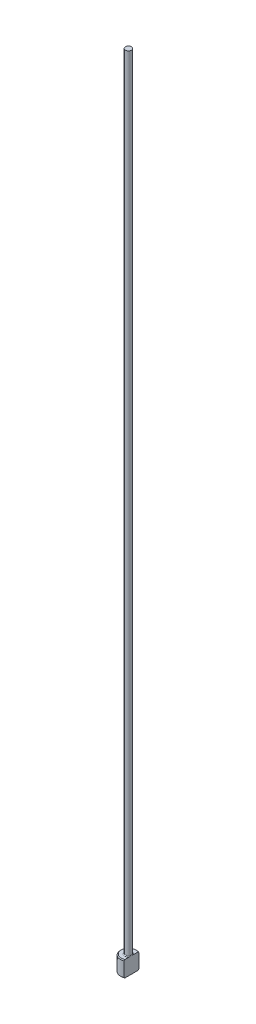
ISO-10303-21;
HEADER;
FILE_DESCRIPTION(('STEP AP214'),'2;1');
FILE_NAME('part.step','',(''),(''),'','','');
FILE_SCHEMA(('AUTOMOTIVE_DESIGN { 1 0 10303 214 1 1 1 1 }'));
ENDSEC;
DATA;
#1=APPLICATION_CONTEXT('core data for automotive mechanical design processes');
#2=APPLICATION_PROTOCOL_DEFINITION('international standard','automotive_design',2000,#1);
#3=PRODUCT_CONTEXT('',#1,'mechanical');
#4=PRODUCT('Part','Part','',(#3));
#5=PRODUCT_RELATED_PRODUCT_CATEGORY('part','',(#4));
#6=PRODUCT_DEFINITION_FORMATION('','',#4);
#7=PRODUCT_DEFINITION_CONTEXT('part definition',#1,'design');
#8=PRODUCT_DEFINITION('design','',#6,#7);
#9=PRODUCT_DEFINITION_SHAPE('','',#8);
#10=(LENGTH_UNIT() NAMED_UNIT(*) SI_UNIT(.MILLI.,.METRE.));
#11=(NAMED_UNIT(*) PLANE_ANGLE_UNIT() SI_UNIT($,.RADIAN.));
#12=(NAMED_UNIT(*) SI_UNIT($,.STERADIAN.) SOLID_ANGLE_UNIT());
#13=UNCERTAINTY_MEASURE_WITH_UNIT(LENGTH_MEASURE(1.E-05),#10,'distance_accuracy_value','');
#14=(GEOMETRIC_REPRESENTATION_CONTEXT(3) GLOBAL_UNCERTAINTY_ASSIGNED_CONTEXT((#13)) GLOBAL_UNIT_ASSIGNED_CONTEXT((#10,
#11,#12)) REPRESENTATION_CONTEXT('',''));
#15=CARTESIAN_POINT('',(0.,0.,0.));
#16=DIRECTION('',(0.,0.,1.));
#17=DIRECTION('',(1.,0.,0.));
#18=AXIS2_PLACEMENT_3D('',#15,#16,#17);
#19=CARTESIAN_POINT('',(0.,0.,0.));
#20=DIRECTION('',(0.,-1.,0.));
#21=DIRECTION('',(0.,0.,-1.));
#22=AXIS2_PLACEMENT_3D('',#19,#20,#21);
#23=PLANE('',#22);
#24=CARTESIAN_POINT('',(0.,0.,0.));
#25=DIRECTION('',(0.,-1.,0.));
#26=DIRECTION('',(0.,0.,-1.));
#27=AXIS2_PLACEMENT_3D('',#24,#25,#26);
#28=CIRCLE('',#27,1.8);
#29=CARTESIAN_POINT('',(0.749999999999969,0.,1.63630681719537));
#30=VERTEX_POINT('',#29);
#31=CARTESIAN_POINT('',(0.749999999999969,0.,-1.63630681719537));
#32=VERTEX_POINT('',#31);
#33=EDGE_CURVE('E98',#30,#32,#28,.T.);
#34=ORIENTED_EDGE('',*,*,#33,.T.);
#35=DIRECTION('',(0.,0.,1.));
#36=VECTOR('',#35,1.);
#37=CARTESIAN_POINT('',(0.749999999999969,0.,1.85404962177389));
#38=LINE('',#37,#36);
#39=EDGE_CURVE('E83',#32,#30,#38,.T.);
#40=ORIENTED_EDGE('',*,*,#39,.T.);
#41=EDGE_LOOP('',(#34,#40));
#42=FACE_BOUND('',#41,.T.);
#43=ADVANCED_FACE('F32',(#42),#23,.T.);
#44=CARTESIAN_POINT('',(0.,259.958771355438,0.));
#45=DIRECTION('',(0.,1.,0.));
#46=DIRECTION('',(0.,0.,1.));
#47=AXIS2_PLACEMENT_3D('',#44,#45,#46);
#48=CYLINDRICAL_SURFACE('',#47,1.99999999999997);
#49=CARTESIAN_POINT('',(0.,3.79999999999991,0.));
#50=DIRECTION('',(0.,1.,0.));
#51=DIRECTION('',(0.,0.,1.));
#52=AXIS2_PLACEMENT_3D('',#49,#50,#51);
#53=CIRCLE('',#52,1.99999999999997);
#54=CARTESIAN_POINT('',(0.749999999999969,3.79999999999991,1.85404962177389));
#55=VERTEX_POINT('',#54);
#56=CARTESIAN_POINT('',(0.749999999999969,3.79999999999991,-1.85404962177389));
#57=VERTEX_POINT('',#56);
#58=EDGE_CURVE('E104',#55,#57,#53,.F.);
#59=ORIENTED_EDGE('',*,*,#58,.T.);
#60=DIRECTION('',(0.,-1.,0.));
#61=VECTOR('',#60,1.);
#62=CARTESIAN_POINT('',(0.749999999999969,200.,-1.85404962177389));
#63=LINE('',#62,#61);
#64=CARTESIAN_POINT('',(0.749999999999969,0.199999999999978,-1.85404962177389));
#65=VERTEX_POINT('',#64);
#66=EDGE_CURVE('E183',#57,#65,#63,.T.);
#67=ORIENTED_EDGE('',*,*,#66,.T.);
#68=CARTESIAN_POINT('',(0.,0.199999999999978,0.));
#69=DIRECTION('',(0.,-1.,0.));
#70=DIRECTION('',(0.,0.,-1.));
#71=AXIS2_PLACEMENT_3D('',#68,#69,#70);
#72=CIRCLE('',#71,1.99999999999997);
#73=CARTESIAN_POINT('',(0.749999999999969,0.199999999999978,1.85404962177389));
#74=VERTEX_POINT('',#73);
#75=EDGE_CURVE('E100',#65,#74,#72,.F.);
#76=ORIENTED_EDGE('',*,*,#75,.T.);
#77=DIRECTION('',(0.,-1.,0.));
#78=VECTOR('',#77,1.);
#79=CARTESIAN_POINT('',(0.749999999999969,200.,1.85404962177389));
#80=LINE('',#79,#78);
#81=EDGE_CURVE('E93',#55,#74,#80,.T.);
#82=ORIENTED_EDGE('',*,*,#81,.F.);
#83=EDGE_LOOP('',(#59,#67,#76,#82));
#84=FACE_BOUND('',#83,.T.);
#85=ADVANCED_FACE('F158',(#84),#48,.T.);
#86=CARTESIAN_POINT('',(-1.99999999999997,4.,0.));
#87=DIRECTION('',(0.,1.,0.));
#88=DIRECTION('',(0.,0.,1.));
#89=AXIS2_PLACEMENT_3D('',#86,#87,#88);
#90=PLANE('',#89);
#91=CARTESIAN_POINT('',(0.,4.,0.));
#92=DIRECTION('',(0.,1.,0.));
#93=DIRECTION('',(0.,0.,1.));
#94=AXIS2_PLACEMENT_3D('',#91,#92,#93);
#95=CIRCLE('',#94,1.79999999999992);
#96=CARTESIAN_POINT('',(0.749999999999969,4.,-1.63630681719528));
#97=VERTEX_POINT('',#96);
#98=CARTESIAN_POINT('',(0.749999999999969,4.,1.63630681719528));
#99=VERTEX_POINT('',#98);
#100=EDGE_CURVE('E178',#97,#99,#95,.T.);
#101=ORIENTED_EDGE('',*,*,#100,.T.);
#102=DIRECTION('',(0.,0.,-1.));
#103=VECTOR('',#102,1.);
#104=CARTESIAN_POINT('',(0.749999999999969,4.,0.));
#105=LINE('',#104,#103);
#106=CARTESIAN_POINT('',(0.749999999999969,3.99999999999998,0.583095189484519));
#107=VERTEX_POINT('',#106);
#108=EDGE_CURVE('E57',#99,#107,#105,.T.);
#109=ORIENTED_EDGE('',*,*,#108,.T.);
#110=CARTESIAN_POINT('',(0.,4.,0.));
#111=DIRECTION('',(0.,1.,0.));
#112=DIRECTION('',(0.,0.,1.));
#113=AXIS2_PLACEMENT_3D('',#110,#111,#112);
#114=CIRCLE('',#113,0.949999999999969);
#115=CARTESIAN_POINT('',(0.749999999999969,3.99999999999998,-0.583095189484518));
#116=VERTEX_POINT('',#115);
#117=EDGE_CURVE('E107',#107,#116,#114,.F.);
#118=ORIENTED_EDGE('',*,*,#117,.T.);
#119=EDGE_CURVE('E136',#116,#97,#105,.T.);
#120=ORIENTED_EDGE('',*,*,#119,.T.);
#121=EDGE_LOOP('',(#101,#109,#118,#120));
#122=FACE_BOUND('',#121,.T.);
#123=ADVANCED_FACE('F147',(#122),#90,.T.);
#124=CARTESIAN_POINT('',(0.,4.,0.));
#125=DIRECTION('',(0.,-1.,0.));
#126=DIRECTION('',(0.,0.,-1.));
#127=AXIS2_PLACEMENT_3D('',#124,#125,#126);
#128=CONICAL_SURFACE('',#127,1.79999999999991,0.785398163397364);
#129=ORIENTED_EDGE('',*,*,#58,.F.);
#130=CARTESIAN_POINT('',(0.749999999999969,1.64933448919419,4.08234297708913));
#131=CARTESIAN_POINT('',(0.749999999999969,1.7568632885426,3.97300940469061));
#132=CARTESIAN_POINT('',(0.749999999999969,1.86432546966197,3.86361021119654));
#133=CARTESIAN_POINT('',(0.749999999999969,2.07918719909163,3.64450528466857));
#134=CARTESIAN_POINT('',(0.749999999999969,2.18658653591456,3.53479934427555));
#135=CARTESIAN_POINT('',(0.749999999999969,2.403309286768,3.31294195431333));
#136=CARTESIAN_POINT('',(0.749999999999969,2.51262786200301,3.20078577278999));
#137=CARTESIAN_POINT('',(0.749999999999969,2.73079905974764,2.97627027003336));
#138=CARTESIAN_POINT('',(0.749999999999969,2.83965207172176,2.86391132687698));
#139=CARTESIAN_POINT('',(0.749999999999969,3.12410072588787,2.56910579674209));
#140=CARTESIAN_POINT('',(0.749999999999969,3.29932702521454,2.38630095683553));
#141=CARTESIAN_POINT('',(0.749999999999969,3.56081447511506,2.11005080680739));
#142=CARTESIAN_POINT('',(0.749999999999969,3.64793893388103,2.01742399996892));
#143=CARTESIAN_POINT('',(0.749999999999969,3.82126966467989,1.83139888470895));
#144=CARTESIAN_POINT('',(0.749999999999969,3.90747636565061,1.7380009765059));
#145=CARTESIAN_POINT('',(0.749999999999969,4.07705927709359,1.55161637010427));
#146=CARTESIAN_POINT('',(0.749999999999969,4.16045863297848,1.4586508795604));
#147=CARTESIAN_POINT('',(0.749999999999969,4.2839983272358,1.31767418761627));
#148=CARTESIAN_POINT('',(0.749999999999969,4.324956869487,1.27038111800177));
#149=CARTESIAN_POINT('',(0.749999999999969,4.40612814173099,1.17516037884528));
#150=CARTESIAN_POINT('',(0.749999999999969,4.44634090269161,1.1272327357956));
#151=CARTESIAN_POINT('',(0.749999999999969,4.52542294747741,1.03092047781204));
#152=CARTESIAN_POINT('',(0.749999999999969,4.56430041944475,0.982542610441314));
#153=CARTESIAN_POINT('',(0.749999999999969,4.64060877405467,0.88466385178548));
#154=CARTESIAN_POINT('',(0.749999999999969,4.67803993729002,0.835163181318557));
#155=CARTESIAN_POINT('',(0.749999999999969,4.75064212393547,0.734748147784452));
#156=CARTESIAN_POINT('',(0.749999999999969,4.78581957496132,0.683838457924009));
#157=CARTESIAN_POINT('',(0.749999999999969,4.85281471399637,0.579868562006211));
#158=CARTESIAN_POINT('',(0.749999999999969,4.8846364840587,0.526811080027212));
#159=CARTESIAN_POINT('',(0.749999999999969,4.92004236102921,0.460353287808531));
#160=CARTESIAN_POINT('',(0.749999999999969,4.92626425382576,0.448355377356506));
#161=CARTESIAN_POINT('',(0.749999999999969,4.93840821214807,0.424205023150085));
#162=CARTESIAN_POINT('',(0.749999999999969,4.94433019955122,0.412052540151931));
#163=CARTESIAN_POINT('',(0.749999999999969,4.96159246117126,0.375357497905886));
#164=CARTESIAN_POINT('',(0.749999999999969,4.97243059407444,0.350574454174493));
#165=CARTESIAN_POINT('',(0.749999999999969,4.99232429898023,0.300598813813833));
#166=CARTESIAN_POINT('',(0.749999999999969,5.00139743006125,0.275413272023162));
#167=CARTESIAN_POINT('',(0.749999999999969,5.01752532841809,0.224391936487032));
#168=CARTESIAN_POINT('',(0.749999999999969,5.02458006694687,0.198556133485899));
#169=CARTESIAN_POINT('',(0.749999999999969,5.03526259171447,0.150878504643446));
#170=CARTESIAN_POINT('',(0.749999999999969,5.03927292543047,0.129123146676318));
#171=CARTESIAN_POINT('',(0.749999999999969,5.04546996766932,0.0853625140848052));
#172=CARTESIAN_POINT('',(0.749999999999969,5.04765728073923,0.0633573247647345));
#173=CARTESIAN_POINT('',(0.749999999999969,5.05127090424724,-0.00270951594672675));
#174=CARTESIAN_POINT('',(0.749999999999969,5.04978253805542,-0.04696569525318));
#175=CARTESIAN_POINT('',(0.749999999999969,5.03814860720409,-0.143936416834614));
#176=CARTESIAN_POINT('',(0.749999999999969,5.02621240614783,-0.196426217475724));
#177=CARTESIAN_POINT('',(0.749999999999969,5.00214641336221,-0.273272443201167));
#178=CARTESIAN_POINT('',(0.749999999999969,4.99304774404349,-0.298672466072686));
#179=CARTESIAN_POINT('',(0.749999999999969,4.9731746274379,-0.348806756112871));
#180=CARTESIAN_POINT('',(0.749999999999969,4.96240055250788,-0.373541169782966));
#181=CARTESIAN_POINT('',(0.749999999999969,4.92901260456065,-0.444792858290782));
#182=CARTESIAN_POINT('',(0.749999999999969,4.90460879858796,-0.490464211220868));
#183=CARTESIAN_POINT('',(0.749999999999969,4.85261191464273,-0.579972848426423));
#184=CARTESIAN_POINT('',(0.749999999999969,4.82501493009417,-0.62380779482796));
#185=CARTESIAN_POINT('',(0.749999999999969,4.76759807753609,-0.710209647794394));
#186=CARTESIAN_POINT('',(0.749999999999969,4.73777062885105,-0.752771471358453));
#187=CARTESIAN_POINT('',(0.749999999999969,4.67663657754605,-0.836824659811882));
#188=CARTESIAN_POINT('',(0.749999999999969,4.64532962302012,-0.878315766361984));
#189=CARTESIAN_POINT('',(0.749999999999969,4.5812089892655,-0.961064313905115));
#190=CARTESIAN_POINT('',(0.749999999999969,4.5483801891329,-1.00230998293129));
#191=CARTESIAN_POINT('',(0.749999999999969,4.48192435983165,-1.08415466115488));
#192=CARTESIAN_POINT('',(0.749999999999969,4.4482972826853,-1.12475363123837));
#193=CARTESIAN_POINT('',(0.749999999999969,4.34669509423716,-1.24559513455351));
#194=CARTESIAN_POINT('',(0.749999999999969,4.2778337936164,-1.32509096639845));
#195=CARTESIAN_POINT('',(0.749999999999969,4.10242211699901,-1.52396732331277));
#196=CARTESIAN_POINT('',(0.749999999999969,3.99494650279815,-1.64252540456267));
#197=CARTESIAN_POINT('',(0.749999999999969,3.77825048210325,-1.8780457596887));
#198=CARTESIAN_POINT('',(0.749999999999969,3.66902991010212,-1.99500788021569));
#199=CARTESIAN_POINT('',(0.749999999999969,3.44939263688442,-2.22808772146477));
#200=CARTESIAN_POINT('',(0.749999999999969,3.33897457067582,-2.34420415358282));
#201=CARTESIAN_POINT('',(0.749999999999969,3.11746229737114,-2.57577975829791));
#202=CARTESIAN_POINT('',(0.749999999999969,3.00636811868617,-2.69123895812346));
#203=CARTESIAN_POINT('',(0.749999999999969,2.79171284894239,-2.91342601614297));
#204=CARTESIAN_POINT('',(0.749999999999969,2.68818407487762,-3.0201851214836));
#205=CARTESIAN_POINT('',(0.749999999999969,2.48083134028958,-3.23341885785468));
#206=CARTESIAN_POINT('',(0.749999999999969,2.37700737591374,-3.33989348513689));
#207=CARTESIAN_POINT('',(0.749999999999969,2.16930389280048,-3.55245914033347));
#208=CARTESIAN_POINT('',(0.749999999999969,2.06542472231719,-3.658550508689));
#209=CARTESIAN_POINT('',(0.749999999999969,1.85749599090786,-3.87056274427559));
#210=CARTESIAN_POINT('',(0.749999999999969,1.75344643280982,-3.97648361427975));
#211=CARTESIAN_POINT('',(0.749999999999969,1.64933448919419,-4.08234297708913));
#212=B_SPLINE_CURVE_WITH_KNOTS('',3,(#130,#131,#132,#133,#134,#135,#136,#137,#138,#139,#140,
#141,#142,#143,#144,#145,#146,#147,#148,#149,#150,#151,#152,#153,#154,#155,#156,#157,#158,#159,
#160,#161,#162,#163,#164,#165,#166,#167,#168,#169,#170,#171,#172,#173,#174,#175,#176,#177,#178,
#179,#180,#181,#182,#183,#184,#185,#186,#187,#188,#189,#190,#191,#192,#193,#194,#195,#196,#197,
#198,#199,#200,#201,#202,#203,#204,#205,#206,#207,#208,#209,#210,#211),.UNSPECIFIED.,.F.,.F.,(4,
2,2,2,2,2,2,2,2,2,2,2,2,2,2,2,2,2,2,2,2,2,2,2,2,2,2,2,2,2,2,2,2,2,2,2,2,2,2,2,4),(0.,
0.460050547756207,0.920626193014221,1.39048289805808,1.85980320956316,2.61945882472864,
3.00094349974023,3.38224127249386,3.75689298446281,3.94457922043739,4.1322576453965,
4.31843090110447,4.50456785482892,4.69014785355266,4.875499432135,4.91604145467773,
4.95659398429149,5.03768920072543,5.11793098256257,5.19817390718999,5.26446717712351,
5.33073845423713,5.46284570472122,5.62332534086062,5.70422568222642,5.78510806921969,
5.940234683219,6.09555312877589,6.25142580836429,6.40733575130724,6.56546927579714,
6.72361232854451,7.03910022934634,7.5191330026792,7.99921158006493,8.47991142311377,
8.96059120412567,9.4067310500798,9.85287674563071,10.2983160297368,10.7437479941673),.UNSPECIFIED.);
#213=EDGE_CURVE('E135',#55,#99,#212,.T.);
#214=ORIENTED_EDGE('',*,*,#213,.T.);
#215=ORIENTED_EDGE('',*,*,#100,.F.);
#216=EDGE_CURVE('E127',#97,#57,#212,.T.);
#217=ORIENTED_EDGE('',*,*,#216,.T.);
#218=EDGE_LOOP('',(#129,#214,#215,#217));
#219=FACE_BOUND('',#218,.T.);
#220=ADVANCED_FACE('F143',(#219),#128,.T.);
#221=CARTESIAN_POINT('',(0.,0.199999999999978,0.));
#222=DIRECTION('',(0.,1.,0.));
#223=DIRECTION('',(0.,0.,1.));
#224=AXIS2_PLACEMENT_3D('',#221,#222,#223);
#225=CONICAL_SURFACE('',#224,1.99999999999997,0.785398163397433);
#226=ORIENTED_EDGE('',*,*,#75,.F.);
#227=CARTESIAN_POINT('',(0.749999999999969,2.3506655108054,-4.08234297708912));
#228=CARTESIAN_POINT('',(0.749999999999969,2.24313671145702,-3.97300940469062));
#229=CARTESIAN_POINT('',(0.749999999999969,2.13567453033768,-3.86361021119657));
#230=CARTESIAN_POINT('',(0.749999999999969,1.92081280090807,-3.64450528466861));
#231=CARTESIAN_POINT('',(0.749999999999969,1.81341346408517,-3.5347993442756));
#232=CARTESIAN_POINT('',(0.749999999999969,1.59669071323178,-3.31294195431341));
#233=CARTESIAN_POINT('',(0.749999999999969,1.48737213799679,-3.20078577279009));
#234=CARTESIAN_POINT('',(0.749999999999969,1.26920094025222,-2.97627027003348));
#235=CARTESIAN_POINT('',(0.749999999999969,1.16034792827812,-2.86391132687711));
#236=CARTESIAN_POINT('',(0.749999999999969,0.87589927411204,-2.56910579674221));
#237=CARTESIAN_POINT('',(0.749999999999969,0.700672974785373,-2.38630095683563));
#238=CARTESIAN_POINT('',(0.749999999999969,0.439185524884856,-2.11005080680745));
#239=CARTESIAN_POINT('',(0.749999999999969,0.352061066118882,-2.01742399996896));
#240=CARTESIAN_POINT('',(0.749999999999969,0.178730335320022,-1.83139888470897));
#241=CARTESIAN_POINT('',(0.749999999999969,0.0925236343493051,-1.73800097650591));
#242=CARTESIAN_POINT('',(0.749999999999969,-0.07705927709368,-1.55161637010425));
#243=CARTESIAN_POINT('',(0.749999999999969,-0.160458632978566,-1.45865087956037));
#244=CARTESIAN_POINT('',(0.749999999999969,-0.283998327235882,-1.31767418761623));
#245=CARTESIAN_POINT('',(0.749999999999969,-0.324956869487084,-1.27038111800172));
#246=CARTESIAN_POINT('',(0.749999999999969,-0.406128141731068,-1.17516037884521));
#247=CARTESIAN_POINT('',(0.749999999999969,-0.446340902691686,-1.12723273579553));
#248=CARTESIAN_POINT('',(0.749999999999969,-0.525422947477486,-1.03092047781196));
#249=CARTESIAN_POINT('',(0.749999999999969,-0.564300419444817,-0.982542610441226));
#250=CARTESIAN_POINT('',(0.749999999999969,-0.64060877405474,-0.88466385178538));
#251=CARTESIAN_POINT('',(0.749999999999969,-0.678039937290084,-0.835163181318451));
#252=CARTESIAN_POINT('',(0.749999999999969,-0.750642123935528,-0.734748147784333));
#253=CARTESIAN_POINT('',(0.749999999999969,-0.785819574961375,-0.683838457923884));
#254=CARTESIAN_POINT('',(0.749999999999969,-0.85281471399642,-0.579868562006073));
#255=CARTESIAN_POINT('',(0.749999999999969,-0.884636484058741,-0.526811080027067));
#256=CARTESIAN_POINT('',(0.749999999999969,-0.920042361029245,-0.460353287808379));
#257=CARTESIAN_POINT('',(0.749999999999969,-0.926264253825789,-0.448355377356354));
#258=CARTESIAN_POINT('',(0.749999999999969,-0.938408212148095,-0.424205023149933));
#259=CARTESIAN_POINT('',(0.749999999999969,-0.944330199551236,-0.41205254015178));
#260=CARTESIAN_POINT('',(0.749999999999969,-0.96159246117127,-0.375357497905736));
#261=CARTESIAN_POINT('',(0.749999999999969,-0.972430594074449,-0.350574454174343));
#262=CARTESIAN_POINT('',(0.749999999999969,-0.992324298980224,-0.300598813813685));
#263=CARTESIAN_POINT('',(0.749999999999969,-1.00139743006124,-0.275413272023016));
#264=CARTESIAN_POINT('',(0.749999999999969,-1.01752532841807,-0.224391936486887));
#265=CARTESIAN_POINT('',(0.749999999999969,-1.02458006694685,-0.198556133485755));
#266=CARTESIAN_POINT('',(0.749999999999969,-1.03526259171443,-0.150878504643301));
#267=CARTESIAN_POINT('',(0.749999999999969,-1.03927292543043,-0.12912314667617));
#268=CARTESIAN_POINT('',(0.749999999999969,-1.04546996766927,-0.0853625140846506));
#269=CARTESIAN_POINT('',(0.749999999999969,-1.04765728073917,-0.0633573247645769));
#270=CARTESIAN_POINT('',(0.749999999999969,-1.05127090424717,0.00270951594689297));
#271=CARTESIAN_POINT('',(0.749999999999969,-1.04978253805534,0.046965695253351));
#272=CARTESIAN_POINT('',(0.749999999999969,-1.03814860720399,0.143936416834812));
#273=CARTESIAN_POINT('',(0.749999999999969,-1.02621240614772,0.196426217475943));
#274=CARTESIAN_POINT('',(0.749999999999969,-1.00214641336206,0.273272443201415));
#275=CARTESIAN_POINT('',(0.749999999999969,-0.993047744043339,0.298672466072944));
#276=CARTESIAN_POINT('',(0.749999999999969,-0.973174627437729,0.348806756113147));
#277=CARTESIAN_POINT('',(0.749999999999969,-0.9624005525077,0.373541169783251));
#278=CARTESIAN_POINT('',(0.749999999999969,-0.929012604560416,0.444792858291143));
#279=CARTESIAN_POINT('',(0.749999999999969,-0.904608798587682,0.490464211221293));
#280=CARTESIAN_POINT('',(0.749999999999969,-0.85261191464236,0.579972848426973));
#281=CARTESIAN_POINT('',(0.749999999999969,-0.825014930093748,0.62380779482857));
#282=CARTESIAN_POINT('',(0.749999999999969,-0.767598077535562,0.710209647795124));
#283=CARTESIAN_POINT('',(0.749999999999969,-0.737770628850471,0.752771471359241));
#284=CARTESIAN_POINT('',(0.749999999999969,-0.676636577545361,0.836824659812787));
#285=CARTESIAN_POINT('',(0.749999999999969,-0.645329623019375,0.878315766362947));
#286=CARTESIAN_POINT('',(0.749999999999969,-0.58120898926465,0.961064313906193));
#287=CARTESIAN_POINT('',(0.749999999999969,-0.548380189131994,1.00230998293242));
#288=CARTESIAN_POINT('',(0.749999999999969,-0.481924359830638,1.08415466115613));
#289=CARTESIAN_POINT('',(0.749999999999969,-0.448297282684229,1.12475363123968));
#290=CARTESIAN_POINT('',(0.749999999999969,-0.346695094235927,1.24559513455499));
#291=CARTESIAN_POINT('',(0.749999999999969,-0.277833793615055,1.32509096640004));
#292=CARTESIAN_POINT('',(0.749999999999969,-0.102422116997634,1.52396732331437));
#293=CARTESIAN_POINT('',(0.749999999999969,0.00505349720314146,1.64252540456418));
#294=CARTESIAN_POINT('',(0.749999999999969,0.221749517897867,1.87804575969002));
#295=CARTESIAN_POINT('',(0.749999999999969,0.330970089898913,1.99500788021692));
#296=CARTESIAN_POINT('',(0.749999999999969,0.550607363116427,2.22808772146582));
#297=CARTESIAN_POINT('',(0.749999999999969,0.661025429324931,2.34420415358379));
#298=CARTESIAN_POINT('',(0.749999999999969,0.882537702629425,2.57577975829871));
#299=CARTESIAN_POINT('',(0.749999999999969,0.993631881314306,2.69123895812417));
#300=CARTESIAN_POINT('',(0.749999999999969,1.20828715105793,2.91342601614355));
#301=CARTESIAN_POINT('',(0.749999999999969,1.31181592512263,3.02018512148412));
#302=CARTESIAN_POINT('',(0.749999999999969,1.51916865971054,3.2334188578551));
#303=CARTESIAN_POINT('',(0.749999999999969,1.62299262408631,3.33989348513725));
#304=CARTESIAN_POINT('',(0.749999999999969,1.83069610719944,3.55245914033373));
#305=CARTESIAN_POINT('',(0.749999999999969,1.93457527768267,3.65855050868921));
#306=CARTESIAN_POINT('',(0.749999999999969,2.14250400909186,3.87056274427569));
#307=CARTESIAN_POINT('',(0.749999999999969,2.24655356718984,3.9764836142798));
#308=CARTESIAN_POINT('',(0.749999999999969,2.3506655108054,4.08234297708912));
#309=B_SPLINE_CURVE_WITH_KNOTS('',3,(#227,#228,#229,#230,#231,#232,#233,#234,#235,#236,#237,
#238,#239,#240,#241,#242,#243,#244,#245,#246,#247,#248,#249,#250,#251,#252,#253,#254,#255,#256,
#257,#258,#259,#260,#261,#262,#263,#264,#265,#266,#267,#268,#269,#270,#271,#272,#273,#274,#275,
#276,#277,#278,#279,#280,#281,#282,#283,#284,#285,#286,#287,#288,#289,#290,#291,#292,#293,#294,
#295,#296,#297,#298,#299,#300,#301,#302,#303,#304,#305,#306,#307,#308),.UNSPECIFIED.,.F.,.F.,(4,
2,2,2,2,2,2,2,2,2,2,2,2,2,2,2,2,2,2,2,2,2,2,2,2,2,2,2,2,2,2,2,2,2,2,2,2,2,2,2,4),(0.,
0.460050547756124,0.920626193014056,1.39048289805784,1.85980320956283,2.61945882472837,
3.00094349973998,3.38224127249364,3.75689298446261,3.94457922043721,4.13225764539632,
4.3184309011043,4.50456785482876,4.69014785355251,4.87549943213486,4.91604145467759,
4.95659398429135,5.03768920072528,5.11793098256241,5.19817390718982,5.26446717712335,
5.33073845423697,5.46284570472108,5.62332534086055,5.70422568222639,5.78510806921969,
5.94023468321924,6.09555312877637,6.251425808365,6.40733575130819,6.56546927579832,
6.72361232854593,7.03910022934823,7.51913300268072,7.99921158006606,8.47991142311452,
8.96059120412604,9.40673105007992,9.85287674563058,10.2983160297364,10.7437479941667),.UNSPECIFIED.);
#310=EDGE_CURVE('E86',#65,#32,#309,.T.);
#311=ORIENTED_EDGE('',*,*,#310,.T.);
#312=ORIENTED_EDGE('',*,*,#33,.F.);
#313=EDGE_CURVE('E89',#30,#74,#309,.T.);
#314=ORIENTED_EDGE('',*,*,#313,.T.);
#315=EDGE_LOOP('',(#226,#311,#312,#314));
#316=FACE_BOUND('',#315,.T.);
#317=ADVANCED_FACE('F97',(#316),#225,.T.);
#318=CARTESIAN_POINT('',(0.,4.19999999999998,0.));
#319=DIRECTION('',(0.,1.,0.));
#320=DIRECTION('',(0.,0.,1.));
#321=AXIS2_PLACEMENT_3D('',#318,#319,#320);
#322=TOROIDAL_SURFACE('',#321,0.949999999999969,0.2);
#323=CARTESIAN_POINT('',(0.749999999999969,4.19999999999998,0.));
#324=CARTESIAN_POINT('',(0.749999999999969,4.20000052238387,0.));
#325=CARTESIAN_POINT('',(0.749999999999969,4.20000104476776,-7.92518434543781E-08));
#326=CARTESIAN_POINT('',(0.749999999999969,4.20000206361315,-3.453450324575E-07));
#327=CARTESIAN_POINT('',(0.749999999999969,4.20000255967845,-5.33493155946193E-07));
#328=CARTESIAN_POINT('',(0.749999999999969,4.20000354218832,-9.91557928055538E-07));
#329=CARTESIAN_POINT('',(0.749999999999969,4.20000402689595,-1.26510932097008E-06));
#330=CARTESIAN_POINT('',(0.749999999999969,4.20000495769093,-1.86638897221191E-06));
#331=CARTESIAN_POINT('',(0.749999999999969,4.20000540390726,-2.19392467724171E-06));
#332=CARTESIAN_POINT('',(0.749999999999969,4.20000683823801,-3.3337095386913E-06));
#333=CARTESIAN_POINT('',(0.749999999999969,4.20000776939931,-4.21820144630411E-06));
#334=CARTESIAN_POINT('',(0.749999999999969,4.20000948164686,-6.08403167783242E-06));
#335=CARTESIAN_POINT('',(0.749999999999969,4.20001026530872,-7.06314146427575E-06));
#336=CARTESIAN_POINT('',(0.749999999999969,4.20001305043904,-1.07283300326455E-05));
#337=CARTESIAN_POINT('',(0.749999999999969,4.20001489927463,-1.35334971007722E-05));
#338=CARTESIAN_POINT('',(0.749999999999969,4.20001806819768,-1.91887701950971E-05));
#339=CARTESIAN_POINT('',(0.749999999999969,4.20001941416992,-2.20250298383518E-05));
#340=CARTESIAN_POINT('',(0.749999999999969,4.20002483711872,-3.36357626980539E-05));
#341=CARTESIAN_POINT('',(0.749999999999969,4.20002876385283,-4.24755662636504E-05));
#342=CARTESIAN_POINT('',(0.749999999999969,4.20003535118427,-5.93015819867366E-05));
#343=CARTESIAN_POINT('',(0.749999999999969,4.20003811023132,-6.72480837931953E-05));
#344=CARTESIAN_POINT('',(0.749999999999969,4.20005910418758,-0.000122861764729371));
#345=CARTESIAN_POINT('',(0.749999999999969,4.2000847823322,-0.000167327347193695));
#346=CARTESIAN_POINT('',(0.749999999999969,4.20017912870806,-0.00033728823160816));
#347=CARTESIAN_POINT('',(0.749999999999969,4.20024226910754,-0.000465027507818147));
#348=CARTESIAN_POINT('',(0.749999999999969,4.20048606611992,-0.000950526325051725));
#349=CARTESIAN_POINT('',(0.749999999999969,4.20067249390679,-0.00130597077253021));
#350=CARTESIAN_POINT('',(0.749999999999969,4.20141452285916,-0.00272815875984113));
#351=CARTESIAN_POINT('',(0.749999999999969,4.20196367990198,-0.00379745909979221));
#352=CARTESIAN_POINT('',(0.749999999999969,4.21079317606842,-0.0209810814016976));
#353=CARTESIAN_POINT('',(0.749999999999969,4.21912708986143,-0.0370747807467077));
#354=CARTESIAN_POINT('',(0.749999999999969,4.23538169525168,-0.0687945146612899));
#355=CARTESIAN_POINT('',(0.749999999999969,4.24330692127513,-0.0844183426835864));
#356=CARTESIAN_POINT('',(0.749999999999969,4.25980152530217,-0.117412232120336));
#357=CARTESIAN_POINT('',(0.749999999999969,4.2683506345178,-0.134792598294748));
#358=CARTESIAN_POINT('',(0.749999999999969,4.28516256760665,-0.169887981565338));
#359=CARTESIAN_POINT('',(0.749999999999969,4.29342203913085,-0.187604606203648));
#360=CARTESIAN_POINT('',(0.749999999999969,4.31367684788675,-0.232718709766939));
#361=CARTESIAN_POINT('',(0.749999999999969,4.32533268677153,-0.260271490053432));
#362=CARTESIAN_POINT('',(0.749999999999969,4.34666110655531,-0.315501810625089));
#363=CARTESIAN_POINT('',(0.749999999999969,4.35636938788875,-0.343165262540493));
#364=CARTESIAN_POINT('',(0.749999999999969,4.37268127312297,-0.396748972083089));
#365=CARTESIAN_POINT('',(0.749999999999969,4.379483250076,-0.42260763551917));
#366=CARTESIAN_POINT('',(0.749999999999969,4.39076706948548,-0.476103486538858));
#367=CARTESIAN_POINT('',(0.749999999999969,4.39512718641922,-0.503767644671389));
#368=CARTESIAN_POINT('',(0.749999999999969,4.40012258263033,-0.559350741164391));
#369=CARTESIAN_POINT('',(0.749999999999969,4.40077276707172,-0.587268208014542));
#370=CARTESIAN_POINT('',(0.749999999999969,4.39725531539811,-0.642496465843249));
#371=CARTESIAN_POINT('',(0.749999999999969,4.39315871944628,-0.669810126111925));
#372=CARTESIAN_POINT('',(0.749999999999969,4.38226759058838,-0.710376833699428));
#373=CARTESIAN_POINT('',(0.749999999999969,4.37764112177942,-0.724213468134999));
#374=CARTESIAN_POINT('',(0.749999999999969,4.36645438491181,-0.751128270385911));
#375=CARTESIAN_POINT('',(0.749999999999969,4.3598916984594,-0.764205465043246));
#376=CARTESIAN_POINT('',(0.749999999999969,4.34591711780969,-0.787020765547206));
#377=CARTESIAN_POINT('',(0.749999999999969,4.33882518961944,-0.796953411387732));
#378=CARTESIAN_POINT('',(0.749999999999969,4.32312129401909,-0.815534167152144));
#379=CARTESIAN_POINT('',(0.749999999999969,4.31451194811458,-0.824184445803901));
#380=CARTESIAN_POINT('',(0.749999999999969,4.29770708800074,-0.838172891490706));
#381=CARTESIAN_POINT('',(0.749999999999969,4.2897756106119,-0.843827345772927));
#382=CARTESIAN_POINT('',(0.749999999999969,4.27308433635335,-0.853755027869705));
#383=CARTESIAN_POINT('',(0.749999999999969,4.26432487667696,-0.858028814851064));
#384=CARTESIAN_POINT('',(0.749999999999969,4.24611994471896,-0.864966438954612));
#385=CARTESIAN_POINT('',(0.749999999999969,4.23667052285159,-0.86762003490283));
#386=CARTESIAN_POINT('',(0.749999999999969,4.21743927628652,-0.871086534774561));
#387=CARTESIAN_POINT('',(0.749999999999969,4.207657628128,-0.871900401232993));
#388=CARTESIAN_POINT('',(0.749999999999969,4.18916476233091,-0.871644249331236));
#389=CARTESIAN_POINT('',(0.749999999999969,4.18045031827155,-0.870765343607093));
#390=CARTESIAN_POINT('',(0.749999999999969,4.16329782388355,-0.867547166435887));
#391=CARTESIAN_POINT('',(0.749999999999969,4.15485975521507,-0.865207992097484));
#392=CARTESIAN_POINT('',(0.749999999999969,4.138510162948,-0.859212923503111));
#393=CARTESIAN_POINT('',(0.749999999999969,4.13059660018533,-0.855562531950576));
#394=CARTESIAN_POINT('',(0.749999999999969,4.11540880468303,-0.847119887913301));
#395=CARTESIAN_POINT('',(0.749999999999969,4.10813470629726,-0.842327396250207));
#396=CARTESIAN_POINT('',(0.749999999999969,4.09350795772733,-0.831172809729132));
#397=CARTESIAN_POINT('',(0.749999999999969,4.08624574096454,-0.824692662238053));
#398=CARTESIAN_POINT('',(0.749999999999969,4.07268239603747,-0.810794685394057));
#399=CARTESIAN_POINT('',(0.749999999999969,4.06638225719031,-0.803375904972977));
#400=CARTESIAN_POINT('',(0.749999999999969,4.05147186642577,-0.783446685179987));
#401=CARTESIAN_POINT('',(0.749999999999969,4.04355238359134,-0.770417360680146));
#402=CARTESIAN_POINT('',(0.749999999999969,4.02991429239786,-0.743286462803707));
#403=CARTESIAN_POINT('',(0.749999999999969,4.02419651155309,-0.729184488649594));
#404=CARTESIAN_POINT('',(0.749999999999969,4.01257018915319,-0.693822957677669));
#405=CARTESIAN_POINT('',(0.749999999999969,4.00774380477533,-0.672209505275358));
#406=CARTESIAN_POINT('',(0.749999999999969,4.00145191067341,-0.628298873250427));
#407=CARTESIAN_POINT('',(0.749999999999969,4.0000267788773,-0.605996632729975));
#408=CARTESIAN_POINT('',(0.749999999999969,3.99995578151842,-0.54611119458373));
#409=CARTESIAN_POINT('',(0.749999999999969,4.00388309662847,-0.508527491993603));
#410=CARTESIAN_POINT('',(0.749999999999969,4.01373246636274,-0.453837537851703));
#411=CARTESIAN_POINT('',(0.749999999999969,4.01754666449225,-0.436272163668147));
#412=CARTESIAN_POINT('',(0.749999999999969,4.02621031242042,-0.401484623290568));
#413=CARTESIAN_POINT('',(0.749999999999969,4.03105449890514,-0.38426118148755));
#414=CARTESIAN_POINT('',(0.749999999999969,4.04486296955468,-0.339542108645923));
#415=CARTESIAN_POINT('',(0.749999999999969,4.05452531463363,-0.312264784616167));
#416=CARTESIAN_POINT('',(0.749999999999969,4.07570310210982,-0.257776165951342));
#417=CARTESIAN_POINT('',(0.749999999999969,4.08725400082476,-0.230578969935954));
#418=CARTESIAN_POINT('',(0.749999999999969,4.10733071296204,-0.185975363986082));
#419=CARTESIAN_POINT('',(0.749999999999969,4.11553018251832,-0.168419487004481));
#420=CARTESIAN_POINT('',(0.749999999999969,4.13221303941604,-0.133639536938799));
#421=CARTESIAN_POINT('',(0.749999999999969,4.14069316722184,-0.116413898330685));
#422=CARTESIAN_POINT('',(0.749999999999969,4.15705001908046,-0.0837133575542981));
#423=CARTESIAN_POINT('',(0.749999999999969,4.16490699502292,-0.0682284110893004));
#424=CARTESIAN_POINT('',(0.749999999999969,4.18101978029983,-0.0367899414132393));
#425=CARTESIAN_POINT('',(0.749999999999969,4.18928002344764,-0.0208385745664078));
#426=CARTESIAN_POINT('',(0.749999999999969,4.19803632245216,-0.00379745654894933));
#427=CARTESIAN_POINT('',(0.749999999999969,4.19858548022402,-0.00272815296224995));
#428=CARTESIAN_POINT('',(0.749999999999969,4.1993275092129,-0.00130596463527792));
#429=CARTESIAN_POINT('',(0.749999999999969,4.19951393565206,-0.000950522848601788));
#430=CARTESIAN_POINT('',(0.749999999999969,4.19975773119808,-0.000465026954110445));
#431=CARTESIAN_POINT('',(0.749999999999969,4.19982087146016,-0.00033728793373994));
#432=CARTESIAN_POINT('',(0.749999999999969,4.19991521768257,-0.000167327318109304));
#433=CARTESIAN_POINT('',(0.749999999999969,4.19994089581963,-0.000122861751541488));
#434=CARTESIAN_POINT('',(0.749999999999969,4.19996188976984,-6.72480870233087E-05));
#435=CARTESIAN_POINT('',(0.749999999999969,4.19996464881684,-5.93015850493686E-05));
#436=CARTESIAN_POINT('',(0.749999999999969,4.19997123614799,-4.24755688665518E-05));
#437=CARTESIAN_POINT('',(0.749999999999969,4.19997516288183,-3.36357649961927E-05));
#438=CARTESIAN_POINT('',(0.749999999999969,4.19998058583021,-2.20250315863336E-05));
#439=CARTESIAN_POINT('',(0.749999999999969,4.19998193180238,-1.91887717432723E-05));
#440=CARTESIAN_POINT('',(0.749999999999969,4.1999851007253,-1.35334982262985E-05));
#441=CARTESIAN_POINT('',(0.749999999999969,4.19998694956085,-1.07283309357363E-05));
#442=CARTESIAN_POINT('',(0.749999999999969,4.19998973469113,-7.06314207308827E-06));
#443=CARTESIAN_POINT('',(0.749999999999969,4.19999051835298,-6.08403221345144E-06));
#444=CARTESIAN_POINT('',(0.749999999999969,4.19999223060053,-4.21820183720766E-06));
#445=CARTESIAN_POINT('',(0.749999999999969,4.19999316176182,-3.33370985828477E-06));
#446=CARTESIAN_POINT('',(0.749999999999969,4.19999459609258,-2.19392490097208E-06));
#447=CARTESIAN_POINT('',(0.749999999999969,4.19999504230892,-1.86638916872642E-06));
#448=CARTESIAN_POINT('',(0.749999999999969,4.19999597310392,-1.26510946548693E-06));
#449=CARTESIAN_POINT('',(0.749999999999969,4.19999645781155,-9.91558047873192E-07));
#450=CARTESIAN_POINT('',(0.749999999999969,4.19999744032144,-5.33493231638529E-07));
#451=CARTESIAN_POINT('',(0.749999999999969,4.19999793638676,-3.45345088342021E-07));
#452=CARTESIAN_POINT('',(0.749999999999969,4.19999895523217,-7.92518659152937E-08));
#453=CARTESIAN_POINT('',(0.749999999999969,4.19999947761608,0.));
#454=CARTESIAN_POINT('',(0.749999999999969,4.19999999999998,0.));
#455=B_SPLINE_CURVE_WITH_KNOTS('',3,(#323,#324,#325,#326,#327,#328,#329,#330,#331,#332,#333,
#334,#335,#336,#337,#338,#339,#340,#341,#342,#343,#344,#345,#346,#347,#348,#349,#350,#351,#352,
#353,#354,#355,#356,#357,#358,#359,#360,#361,#362,#363,#364,#365,#366,#367,#368,#369,#370,#371,
#372,#373,#374,#375,#376,#377,#378,#379,#380,#381,#382,#383,#384,#385,#386,#387,#388,#389,#390,
#391,#392,#393,#394,#395,#396,#397,#398,#399,#400,#401,#402,#403,#404,#405,#406,#407,#408,#409,
#410,#411,#412,#413,#414,#415,#416,#417,#418,#419,#420,#421,#422,#423,#424,#425,#426,#427,#428,
#429,#430,#431,#432,#433,#434,#435,#436,#437,#438,#439,#440,#441,#442,#443,#444,#445,#446,#447,
#448,#449,#450,#451,#452,#453,#454),.UNSPECIFIED.,.T.,.F.,(4,2,2,2,2,2,2,2,2,2,2,2,2,2,2,2,2,2,
2,2,2,2,2,2,2,2,2,2,2,2,2,2,2,2,2,2,2,2,2,2,2,2,2,2,2,2,2,2,2,2,2,2,2,2,2,2,2,2,2,2,2,2,2,2,2,
4),(0.,1.56543919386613E-06,3.15006544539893E-06,4.81434341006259E-06,6.47280876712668E-06,
1.03067365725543E-05,1.40657946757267E-05,2.41046687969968E-05,3.35140856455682E-05,
6.25197195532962E-05,8.77289705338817E-05,0.000240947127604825,0.000669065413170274,
0.00187238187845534,0.00547938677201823,0.0598417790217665,0.112399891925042,0.170503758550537,
0.229141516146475,0.318850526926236,0.40672395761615,0.486842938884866,0.570663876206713,
0.654147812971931,0.736398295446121,0.780052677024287,0.823761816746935,0.860241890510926,
0.896659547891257,0.925764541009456,0.954857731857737,0.984132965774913,1.01339287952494,
1.03954157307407,1.06568852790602,1.09172701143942,1.11777095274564,1.14686281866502,
1.17598440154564,1.22146737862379,1.26696743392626,1.33303548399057,1.39988404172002,
1.51253340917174,1.56644503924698,1.62008752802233,1.70682485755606,1.79543193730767,
1.85355663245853,1.91115281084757,1.96324672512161,2.0171283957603,2.02073541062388,
2.0219387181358,2.02236683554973,2.02252005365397,2.02254526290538,2.02257426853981,
2.0225836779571,2.02259371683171,2.02259747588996,2.02260130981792,2.02260296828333,
2.02260463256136,2.02260621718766,2.0226077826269),.UNSPECIFIED.);
#456=CARTESIAN_POINT('',(0.749999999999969,4.19999999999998,0.));
#457=VERTEX_POINT('',#456);
#458=EDGE_CURVE('E11',#116,#457,#455,.T.);
#459=ORIENTED_EDGE('',*,*,#458,.F.);
#460=ORIENTED_EDGE('',*,*,#117,.F.);
#461=CARTESIAN_POINT('',(0.749999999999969,4.19999999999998,0.));
#462=CARTESIAN_POINT('',(0.749999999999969,4.19999947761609,0.));
#463=CARTESIAN_POINT('',(0.749999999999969,4.1999989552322,7.92518434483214E-08));
#464=CARTESIAN_POINT('',(0.749999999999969,4.19999793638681,3.45345032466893E-07));
#465=CARTESIAN_POINT('',(0.749999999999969,4.19999744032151,5.33493155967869E-07));
#466=CARTESIAN_POINT('',(0.749999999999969,4.19999645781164,9.91557928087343E-07));
#467=CARTESIAN_POINT('',(0.749999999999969,4.19999597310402,1.26510932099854E-06));
#468=CARTESIAN_POINT('',(0.749999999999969,4.19999504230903,1.86638897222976E-06));
#469=CARTESIAN_POINT('',(0.749999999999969,4.1999945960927,2.19392467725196E-06));
#470=CARTESIAN_POINT('',(0.749999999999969,4.19999316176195,3.33370953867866E-06));
#471=CARTESIAN_POINT('',(0.749999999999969,4.19999223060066,4.21820144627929E-06));
#472=CARTESIAN_POINT('',(0.749999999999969,4.1999905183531,6.08403167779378E-06));
#473=CARTESIAN_POINT('',(0.749999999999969,4.19998973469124,7.06314146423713E-06));
#474=CARTESIAN_POINT('',(0.749999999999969,4.19998694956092,1.07283300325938E-05));
#475=CARTESIAN_POINT('',(0.749999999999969,4.19998510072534,1.35334971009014E-05));
#476=CARTESIAN_POINT('',(0.749999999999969,4.19998193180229,1.91887701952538E-05));
#477=CARTESIAN_POINT('',(0.749999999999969,4.19998058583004,2.20250298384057E-05));
#478=CARTESIAN_POINT('',(0.749999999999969,4.19997516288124,3.36357626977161E-05));
#479=CARTESIAN_POINT('',(0.749999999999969,4.19997123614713,4.24755662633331E-05));
#480=CARTESIAN_POINT('',(0.749999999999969,4.19996464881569,5.93015819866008E-05));
#481=CARTESIAN_POINT('',(0.749999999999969,4.19996188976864,6.72480837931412E-05));
#482=CARTESIAN_POINT('',(0.749999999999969,4.19994089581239,0.000122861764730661));
#483=CARTESIAN_POINT('',(0.749999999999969,4.19991521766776,0.000167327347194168));
#484=CARTESIAN_POINT('',(0.749999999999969,4.19982087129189,0.000337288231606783));
#485=CARTESIAN_POINT('',(0.749999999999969,4.19975773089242,0.000465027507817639));
#486=CARTESIAN_POINT('',(0.749999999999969,4.19951393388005,0.000950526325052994));
#487=CARTESIAN_POINT('',(0.749999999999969,4.19932750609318,0.00130597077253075));
#488=CARTESIAN_POINT('',(0.749999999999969,4.1985854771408,0.00272815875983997));
#489=CARTESIAN_POINT('',(0.749999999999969,4.19803632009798,0.00379745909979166));
#490=CARTESIAN_POINT('',(0.749999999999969,4.18920682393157,0.0209810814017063));
#491=CARTESIAN_POINT('',(0.749999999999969,4.18087291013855,0.037074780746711));
#492=CARTESIAN_POINT('',(0.749999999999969,4.16461830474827,0.0687945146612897));
#493=CARTESIAN_POINT('',(0.749999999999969,4.15669307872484,0.084418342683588));
#494=CARTESIAN_POINT('',(0.749999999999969,4.14019847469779,0.117412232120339));
#495=CARTESIAN_POINT('',(0.749999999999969,4.13164936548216,0.13479259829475));
#496=CARTESIAN_POINT('',(0.749999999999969,4.11483743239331,0.169887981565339));
#497=CARTESIAN_POINT('',(0.749999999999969,4.10657796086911,0.187604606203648));
#498=CARTESIAN_POINT('',(0.749999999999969,4.08632315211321,0.232718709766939));
#499=CARTESIAN_POINT('',(0.749999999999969,4.07466731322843,0.260271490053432));
#500=CARTESIAN_POINT('',(0.749999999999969,4.05333889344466,0.315501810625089));
#501=CARTESIAN_POINT('',(0.749999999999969,4.04363061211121,0.343165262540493));
#502=CARTESIAN_POINT('',(0.749999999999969,4.02731872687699,0.396748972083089));
#503=CARTESIAN_POINT('',(0.749999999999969,4.02051674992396,0.42260763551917));
#504=CARTESIAN_POINT('',(0.749999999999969,4.00923293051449,0.476103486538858));
#505=CARTESIAN_POINT('',(0.749999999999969,4.00487281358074,0.503767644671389));
#506=CARTESIAN_POINT('',(0.749999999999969,3.99987741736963,0.559350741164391));
#507=CARTESIAN_POINT('',(0.749999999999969,3.99922723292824,0.587268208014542));
#508=CARTESIAN_POINT('',(0.749999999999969,4.00274468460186,0.642496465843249));
#509=CARTESIAN_POINT('',(0.749999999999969,4.00684128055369,0.669810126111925));
#510=CARTESIAN_POINT('',(0.749999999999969,4.01773240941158,0.710376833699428));
#511=CARTESIAN_POINT('',(0.749999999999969,4.02235887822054,0.724213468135));
#512=CARTESIAN_POINT('',(0.749999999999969,4.03354561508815,0.751128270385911));
#513=CARTESIAN_POINT('',(0.749999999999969,4.04010830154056,0.764205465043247));
#514=CARTESIAN_POINT('',(0.749999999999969,4.05408288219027,0.787020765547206));
#515=CARTESIAN_POINT('',(0.749999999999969,4.06117481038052,0.796953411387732));
#516=CARTESIAN_POINT('',(0.749999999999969,4.07687870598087,0.815534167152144));
#517=CARTESIAN_POINT('',(0.749999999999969,4.08548805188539,0.824184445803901));
#518=CARTESIAN_POINT('',(0.749999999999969,4.10229291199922,0.838172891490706));
#519=CARTESIAN_POINT('',(0.749999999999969,4.11022438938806,0.843827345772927));
#520=CARTESIAN_POINT('',(0.749999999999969,4.12691566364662,0.853755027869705));
#521=CARTESIAN_POINT('',(0.749999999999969,4.135675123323,0.858028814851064));
#522=CARTESIAN_POINT('',(0.749999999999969,4.153880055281,0.864966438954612));
#523=CARTESIAN_POINT('',(0.749999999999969,4.16332947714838,0.86762003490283));
#524=CARTESIAN_POINT('',(0.749999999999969,4.18256072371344,0.871086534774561));
#525=CARTESIAN_POINT('',(0.749999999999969,4.19234237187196,0.871900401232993));
#526=CARTESIAN_POINT('',(0.749999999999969,4.21083523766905,0.871644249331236));
#527=CARTESIAN_POINT('',(0.749999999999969,4.21954968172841,0.870765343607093));
#528=CARTESIAN_POINT('',(0.749999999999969,4.23670217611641,0.867547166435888));
#529=CARTESIAN_POINT('',(0.749999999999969,4.2451402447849,0.865207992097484));
#530=CARTESIAN_POINT('',(0.749999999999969,4.26148983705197,0.859212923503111));
#531=CARTESIAN_POINT('',(0.749999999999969,4.26940339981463,0.855562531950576));
#532=CARTESIAN_POINT('',(0.749999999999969,4.28459119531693,0.847119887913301));
#533=CARTESIAN_POINT('',(0.749999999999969,4.2918652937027,0.842327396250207));
#534=CARTESIAN_POINT('',(0.749999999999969,4.30649204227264,0.831172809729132));
#535=CARTESIAN_POINT('',(0.749999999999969,4.31375425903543,0.824692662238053));
#536=CARTESIAN_POINT('',(0.749999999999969,4.32731760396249,0.810794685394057));
#537=CARTESIAN_POINT('',(0.749999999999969,4.33361774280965,0.803375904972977));
#538=CARTESIAN_POINT('',(0.749999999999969,4.34852813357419,0.783446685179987));
#539=CARTESIAN_POINT('',(0.749999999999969,4.35644761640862,0.770417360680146));
#540=CARTESIAN_POINT('',(0.749999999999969,4.3700857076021,0.743286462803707));
#541=CARTESIAN_POINT('',(0.749999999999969,4.37580348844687,0.729184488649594));
#542=CARTESIAN_POINT('',(0.749999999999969,4.38742981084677,0.693822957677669));
#543=CARTESIAN_POINT('',(0.749999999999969,4.39225619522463,0.672209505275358));
#544=CARTESIAN_POINT('',(0.749999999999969,4.39854808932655,0.628298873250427));
#545=CARTESIAN_POINT('',(0.749999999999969,4.39997322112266,0.605996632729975));
#546=CARTESIAN_POINT('',(0.749999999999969,4.40004421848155,0.54611119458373));
#547=CARTESIAN_POINT('',(0.749999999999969,4.3961169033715,0.508527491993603));
#548=CARTESIAN_POINT('',(0.749999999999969,4.38626753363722,0.453837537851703));
#549=CARTESIAN_POINT('',(0.749999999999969,4.38245333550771,0.436272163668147));
#550=CARTESIAN_POINT('',(0.749999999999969,4.37378968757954,0.401484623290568));
#551=CARTESIAN_POINT('',(0.749999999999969,4.36894550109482,0.38426118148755));
#552=CARTESIAN_POINT('',(0.749999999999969,4.35513703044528,0.339542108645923));
#553=CARTESIAN_POINT('',(0.749999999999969,4.34547468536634,0.312264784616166));
#554=CARTESIAN_POINT('',(0.749999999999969,4.32429689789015,0.257776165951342));
#555=CARTESIAN_POINT('',(0.749999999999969,4.3127459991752,0.230578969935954));
#556=CARTESIAN_POINT('',(0.749999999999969,4.29266928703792,0.185975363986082));
#557=CARTESIAN_POINT('',(0.749999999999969,4.28446981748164,0.168419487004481));
#558=CARTESIAN_POINT('',(0.749999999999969,4.26778696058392,0.133639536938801));
#559=CARTESIAN_POINT('',(0.749999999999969,4.25930683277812,0.116413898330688));
#560=CARTESIAN_POINT('',(0.749999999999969,4.2429499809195,0.0837133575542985));
#561=CARTESIAN_POINT('',(0.749999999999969,4.23509300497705,0.0682284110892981));
#562=CARTESIAN_POINT('',(0.749999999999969,4.21898021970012,0.0367899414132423));
#563=CARTESIAN_POINT('',(0.749999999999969,4.2107199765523,0.020838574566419));
#564=CARTESIAN_POINT('',(0.749999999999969,4.20196367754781,0.00379745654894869));
#565=CARTESIAN_POINT('',(0.749999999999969,4.20141451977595,0.00272815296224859));
#566=CARTESIAN_POINT('',(0.749999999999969,4.20067249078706,0.00130596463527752));
#567=CARTESIAN_POINT('',(0.749999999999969,4.2004860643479,0.000950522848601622));
#568=CARTESIAN_POINT('',(0.749999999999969,4.20024226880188,0.00046502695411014));
#569=CARTESIAN_POINT('',(0.749999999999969,4.2001791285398,0.000337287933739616));
#570=CARTESIAN_POINT('',(0.749999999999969,4.20008478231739,0.000167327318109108));
#571=CARTESIAN_POINT('',(0.749999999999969,4.20005910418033,0.000122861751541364));
#572=CARTESIAN_POINT('',(0.749999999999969,4.20003811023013,6.72480870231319E-05));
#573=CARTESIAN_POINT('',(0.749999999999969,4.20003535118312,5.93015850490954E-05));
#574=CARTESIAN_POINT('',(0.749999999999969,4.20002876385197,4.24755688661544E-05));
#575=CARTESIAN_POINT('',(0.749999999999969,4.20002483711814,3.36357649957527E-05));
#576=CARTESIAN_POINT('',(0.749999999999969,4.20001941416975,2.20250315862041E-05));
#577=CARTESIAN_POINT('',(0.749999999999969,4.20001806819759,1.91887717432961E-05));
#578=CARTESIAN_POINT('',(0.749999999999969,4.20001489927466,1.35334982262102E-05));
#579=CARTESIAN_POINT('',(0.749999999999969,4.20001305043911,1.07283309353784E-05));
#580=CARTESIAN_POINT('',(0.749999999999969,4.20001026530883,7.06314207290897E-06));
#581=CARTESIAN_POINT('',(0.749999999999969,4.20000948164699,6.0840322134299E-06));
#582=CARTESIAN_POINT('',(0.749999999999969,4.20000776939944,4.21820183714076E-06));
#583=CARTESIAN_POINT('',(0.749999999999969,4.20000683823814,3.33370985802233E-06));
#584=CARTESIAN_POINT('',(0.749999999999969,4.20000540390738,2.1939249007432E-06));
#585=CARTESIAN_POINT('',(0.749999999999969,4.20000495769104,1.8663891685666E-06));
#586=CARTESIAN_POINT('',(0.749999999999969,4.20000402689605,1.26510946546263E-06));
#587=CARTESIAN_POINT('',(0.749999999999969,4.20000354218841,9.91558047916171E-07));
#588=CARTESIAN_POINT('',(0.749999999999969,4.20000255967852,5.33493231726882E-07));
#589=CARTESIAN_POINT('',(0.749999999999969,4.20000206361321,3.45345088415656E-07));
#590=CARTESIAN_POINT('',(0.749999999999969,4.20000104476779,7.92518659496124E-08));
#591=CARTESIAN_POINT('',(0.749999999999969,4.20000052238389,0.));
#592=CARTESIAN_POINT('',(0.749999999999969,4.19999999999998,0.));
#593=B_SPLINE_CURVE_WITH_KNOTS('',3,(#461,#462,#463,#464,#465,#466,#467,#468,#469,#470,#471,
#472,#473,#474,#475,#476,#477,#478,#479,#480,#481,#482,#483,#484,#485,#486,#487,#488,#489,#490,
#491,#492,#493,#494,#495,#496,#497,#498,#499,#500,#501,#502,#503,#504,#505,#506,#507,#508,#509,
#510,#511,#512,#513,#514,#515,#516,#517,#518,#519,#520,#521,#522,#523,#524,#525,#526,#527,#528,
#529,#530,#531,#532,#533,#534,#535,#536,#537,#538,#539,#540,#541,#542,#543,#544,#545,#546,#547,
#548,#549,#550,#551,#552,#553,#554,#555,#556,#557,#558,#559,#560,#561,#562,#563,#564,#565,#566,
#567,#568,#569,#570,#571,#572,#573,#574,#575,#576,#577,#578,#579,#580,#581,#582,#583,#584,#585,
#586,#587,#588,#589,#590,#591,#592),.UNSPECIFIED.,.T.,.F.,(4,2,2,2,2,2,2,2,2,2,2,2,2,2,2,2,2,2,
2,2,2,2,2,2,2,2,2,2,2,2,2,2,2,2,2,2,2,2,2,2,2,2,2,2,2,2,2,2,2,2,2,2,2,2,2,2,2,2,2,2,2,2,2,2,2,
4),(0.,1.5654391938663E-06,3.15006544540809E-06,4.81434341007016E-06,6.4728087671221E-06,
1.03067365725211E-05,1.40657946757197E-05,2.41046687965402E-05,3.35140856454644E-05,
6.25197195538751E-05,8.77289705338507E-05,0.000240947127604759,0.000669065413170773,
0.00187238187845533,0.00547938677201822,0.0598417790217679,0.112399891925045,0.170503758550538,
0.229141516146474,0.318850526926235,0.40672395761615,0.486842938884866,0.570663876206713,
0.654147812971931,0.736398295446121,0.780052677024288,0.823761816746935,0.860241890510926,
0.896659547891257,0.925764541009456,0.954857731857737,0.984132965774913,1.01339287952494,
1.03954157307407,1.06568852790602,1.09172701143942,1.11777095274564,1.14686281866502,
1.17598440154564,1.22146737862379,1.26696743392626,1.33303548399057,1.39988404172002,
1.51253340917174,1.56644503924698,1.62008752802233,1.70682485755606,1.79543193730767,
1.85355663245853,1.91115281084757,1.96324672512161,2.0171283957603,2.02073541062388,
2.0219387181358,2.02236683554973,2.02252005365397,2.02254526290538,2.02257426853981,
2.0225836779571,2.02259371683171,2.02259747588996,2.02260130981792,2.02260296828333,
2.02260463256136,2.02260621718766,2.0226077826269),.UNSPECIFIED.);
#594=EDGE_CURVE('E46',#457,#107,#593,.T.);
#595=ORIENTED_EDGE('',*,*,#594,.F.);
#596=CARTESIAN_POINT('',(0.,4.19999999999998,0.));
#597=DIRECTION('',(0.,1.,0.));
#598=DIRECTION('',(0.,0.,1.));
#599=AXIS2_PLACEMENT_3D('',#596,#597,#598);
#600=CIRCLE('',#599,0.749999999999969);
#601=EDGE_CURVE('E103',#457,#457,#600,.T.);
#602=ORIENTED_EDGE('',*,*,#601,.F.);
#603=EDGE_LOOP('',(#459,#460,#595,#602));
#604=FACE_BOUND('',#603,.T.);
#605=ADVANCED_FACE('F34',(#604),#322,.F.);
#606=CARTESIAN_POINT('',(0.,259.958771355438,0.));
#607=DIRECTION('',(0.,1.,0.));
#608=DIRECTION('',(0.,0.,1.));
#609=AXIS2_PLACEMENT_3D('',#606,#607,#608);
#610=CYLINDRICAL_SURFACE('',#609,0.749999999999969);
#611=ORIENTED_EDGE('',*,*,#601,.T.);
#612=EDGE_LOOP('',(#611));
#613=FACE_BOUND('',#612,.T.);
#614=CARTESIAN_POINT('',(0.,200.,0.));
#615=DIRECTION('',(0.,1.,0.));
#616=DIRECTION('',(0.,0.,1.));
#617=AXIS2_PLACEMENT_3D('',#614,#615,#616);
#618=CIRCLE('',#617,0.749999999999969);
#619=CARTESIAN_POINT('',(0.,200.,0.749999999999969));
#620=VERTEX_POINT('',#619);
#621=EDGE_CURVE('E101',#620,#620,#618,.T.);
#622=ORIENTED_EDGE('',*,*,#621,.F.);
#623=EDGE_LOOP('',(#622));
#624=FACE_BOUND('',#623,.T.);
#625=ADVANCED_FACE('F155',(#613,#624),#610,.T.);
#626=CARTESIAN_POINT('',(-0.749999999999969,200.,0.));
#627=DIRECTION('',(0.,1.,0.));
#628=DIRECTION('',(0.,0.,1.));
#629=AXIS2_PLACEMENT_3D('',#626,#627,#628);
#630=PLANE('',#629);
#631=ORIENTED_EDGE('',*,*,#621,.T.);
#632=EDGE_LOOP('',(#631));
#633=FACE_BOUND('',#632,.T.);
#634=ADVANCED_FACE('F121',(#633),#630,.T.);
#635=CARTESIAN_POINT('',(0.749999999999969,200.,1.85404962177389));
#636=DIRECTION('',(1.,0.,0.));
#637=DIRECTION('',(0.,0.,-1.));
#638=AXIS2_PLACEMENT_3D('',#635,#636,#637);
#639=PLANE('',#638);
#640=ORIENTED_EDGE('',*,*,#66,.F.);
#641=ORIENTED_EDGE('',*,*,#216,.F.);
#642=ORIENTED_EDGE('',*,*,#119,.F.);
#643=ORIENTED_EDGE('',*,*,#458,.T.);
#644=ORIENTED_EDGE('',*,*,#594,.T.);
#645=ORIENTED_EDGE('',*,*,#108,.F.);
#646=ORIENTED_EDGE('',*,*,#213,.F.);
#647=ORIENTED_EDGE('',*,*,#81,.T.);
#648=ORIENTED_EDGE('',*,*,#313,.F.);
#649=ORIENTED_EDGE('',*,*,#39,.F.);
#650=ORIENTED_EDGE('',*,*,#310,.F.);
#651=EDGE_LOOP('',(#640,#641,#642,#643,#644,#645,#646,#647,#648,#649,#650));
#652=FACE_BOUND('',#651,.T.);
#653=ADVANCED_FACE('F85',(#652),#639,.T.);
#654=CLOSED_SHELL('',(#43,#85,#123,#220,#317,#605,#625,#634,#653));
#655=MANIFOLD_SOLID_BREP('B2',#654);
#656=ADVANCED_BREP_SHAPE_REPRESENTATION('',(#18,#655),#14);
#657=SHAPE_DEFINITION_REPRESENTATION(#9,#656);
ENDSEC;
END-ISO-10303-21;
